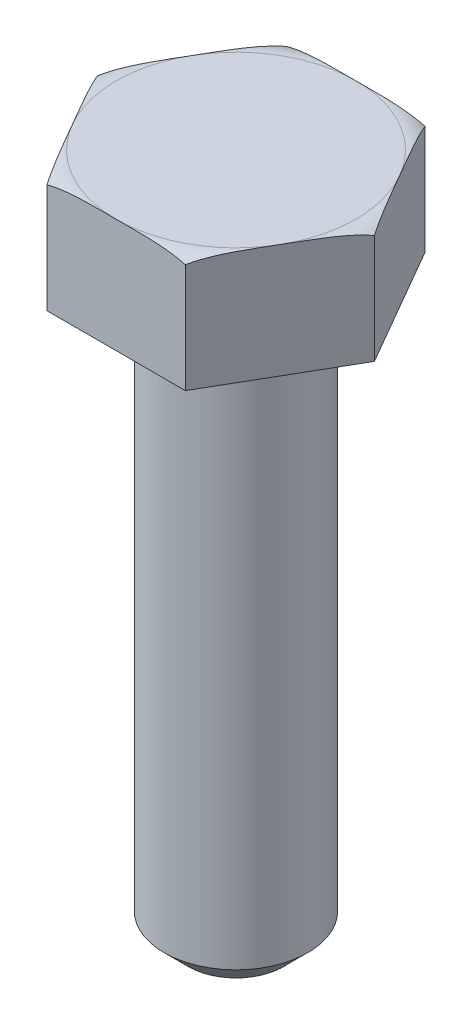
ISO-10303-21;
HEADER;
FILE_DESCRIPTION(('STEP AP214'),'2;1');
FILE_NAME('part.step','',(''),(''),'','','');
FILE_SCHEMA(('AUTOMOTIVE_DESIGN { 1 0 10303 214 1 1 1 1 }'));
ENDSEC;
DATA;
#1=APPLICATION_CONTEXT('core data for automotive mechanical design processes');
#2=APPLICATION_PROTOCOL_DEFINITION('international standard','automotive_design',2000,#1);
#3=PRODUCT_CONTEXT('',#1,'mechanical');
#4=PRODUCT('Part','Part','',(#3));
#5=PRODUCT_RELATED_PRODUCT_CATEGORY('part','',(#4));
#6=PRODUCT_DEFINITION_FORMATION('','',#4);
#7=PRODUCT_DEFINITION_CONTEXT('part definition',#1,'design');
#8=PRODUCT_DEFINITION('design','',#6,#7);
#9=PRODUCT_DEFINITION_SHAPE('','',#8);
#10=(LENGTH_UNIT() NAMED_UNIT(*) SI_UNIT(.MILLI.,.METRE.));
#11=(NAMED_UNIT(*) PLANE_ANGLE_UNIT() SI_UNIT($,.RADIAN.));
#12=(NAMED_UNIT(*) SI_UNIT($,.STERADIAN.) SOLID_ANGLE_UNIT());
#13=UNCERTAINTY_MEASURE_WITH_UNIT(LENGTH_MEASURE(1.E-05),#10,'distance_accuracy_value','');
#14=(GEOMETRIC_REPRESENTATION_CONTEXT(3) GLOBAL_UNCERTAINTY_ASSIGNED_CONTEXT((#13)) GLOBAL_UNIT_ASSIGNED_CONTEXT((#10,
#11,#12)) REPRESENTATION_CONTEXT('',''));
#15=CARTESIAN_POINT('',(0.,0.,0.));
#16=DIRECTION('',(0.,0.,1.));
#17=DIRECTION('',(1.,0.,0.));
#18=AXIS2_PLACEMENT_3D('',#15,#16,#17);
#19=CARTESIAN_POINT('',(1.6,-19.,0.));
#20=DIRECTION('',(0.,1.,0.));
#21=DIRECTION('',(-1.,0.,0.));
#22=AXIS2_PLACEMENT_3D('',#19,#20,#21);
#23=PLANE('',#22);
#24=CARTESIAN_POINT('',(0.,-19.,0.));
#25=DIRECTION('',(0.,1.,0.));
#26=DIRECTION('',(-1.,0.,0.));
#27=AXIS2_PLACEMENT_3D('',#24,#25,#26);
#28=CIRCLE('',#27,1.6);
#29=CARTESIAN_POINT('',(-1.6,-19.,0.));
#30=VERTEX_POINT('',#29);
#31=EDGE_CURVE('E11',#30,#30,#28,.T.);
#32=ORIENTED_EDGE('',*,*,#31,.F.);
#33=EDGE_LOOP('',(#32));
#34=FACE_BOUND('',#33,.T.);
#35=ADVANCED_FACE('F47',(#34),#23,.F.);
#36=CARTESIAN_POINT('',(0.,-19.,0.));
#37=DIRECTION('',(0.,1.,0.));
#38=DIRECTION('',(-1.,0.,0.));
#39=AXIS2_PLACEMENT_3D('',#36,#37,#38);
#40=CONICAL_SURFACE('',#39,1.6,0.785398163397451);
#41=CARTESIAN_POINT('',(0.,-18.2,0.));
#42=DIRECTION('',(0.,1.,0.));
#43=DIRECTION('',(-1.,0.,0.));
#44=AXIS2_PLACEMENT_3D('',#41,#42,#43);
#45=CIRCLE('',#44,2.4);
#46=CARTESIAN_POINT('',(-2.4,-18.2,0.));
#47=VERTEX_POINT('',#46);
#48=EDGE_CURVE('E53',#47,#47,#45,.T.);
#49=ORIENTED_EDGE('',*,*,#48,.F.);
#50=EDGE_LOOP('',(#49));
#51=FACE_BOUND('',#50,.T.);
#52=ORIENTED_EDGE('',*,*,#31,.T.);
#53=EDGE_LOOP('',(#52));
#54=FACE_BOUND('',#53,.T.);
#55=ADVANCED_FACE('F77',(#51,#54),#40,.T.);
#56=CARTESIAN_POINT('',(0.,0.,0.));
#57=DIRECTION('',(0.,1.,0.));
#58=DIRECTION('',(-1.,0.,0.));
#59=AXIS2_PLACEMENT_3D('',#56,#57,#58);
#60=CYLINDRICAL_SURFACE('',#59,2.4);
#61=CARTESIAN_POINT('',(0.,-0.24,0.));
#62=DIRECTION('',(0.,1.,0.));
#63=DIRECTION('',(-1.,0.,0.));
#64=AXIS2_PLACEMENT_3D('',#61,#62,#63);
#65=CIRCLE('',#64,2.4);
#66=CARTESIAN_POINT('',(-2.39999999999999,-0.24,0.));
#67=VERTEX_POINT('',#66);
#68=EDGE_CURVE('E57',#67,#67,#65,.T.);
#69=ORIENTED_EDGE('',*,*,#68,.F.);
#70=EDGE_LOOP('',(#69));
#71=FACE_BOUND('',#70,.T.);
#72=ORIENTED_EDGE('',*,*,#48,.T.);
#73=EDGE_LOOP('',(#72));
#74=FACE_BOUND('',#73,.T.);
#75=ADVANCED_FACE('F72',(#71,#74),#60,.T.);
#76=CARTESIAN_POINT('',(0.,-0.24,0.));
#77=DIRECTION('',(0.,1.,0.));
#78=DIRECTION('',(-1.,0.,0.));
#79=AXIS2_PLACEMENT_3D('',#76,#77,#78);
#80=TOROIDAL_SURFACE('',#79,2.64,0.24);
#81=CARTESIAN_POINT('',(0.,0.,0.));
#82=DIRECTION('',(0.,1.,0.));
#83=DIRECTION('',(-1.,0.,0.));
#84=AXIS2_PLACEMENT_3D('',#81,#82,#83);
#85=CIRCLE('',#84,2.64);
#86=CARTESIAN_POINT('',(-2.63999999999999,0.,0.));
#87=VERTEX_POINT('',#86);
#88=EDGE_CURVE('E61',#87,#87,#85,.T.);
#89=ORIENTED_EDGE('',*,*,#88,.F.);
#90=EDGE_LOOP('',(#89));
#91=FACE_BOUND('',#90,.T.);
#92=ORIENTED_EDGE('',*,*,#68,.T.);
#93=EDGE_LOOP('',(#92));
#94=FACE_BOUND('',#93,.T.);
#95=ADVANCED_FACE('F69',(#91,#94),#80,.F.);
#96=CARTESIAN_POINT('',(0.,0.,0.));
#97=DIRECTION('',(0.,-1.,0.));
#98=DIRECTION('',(1.,0.,0.));
#99=AXIS2_PLACEMENT_3D('',#96,#97,#98);
#100=PLANE('',#99);
#101=ORIENTED_EDGE('',*,*,#88,.T.);
#102=EDGE_LOOP('',(#101));
#103=FACE_BOUND('',#102,.T.);
#104=ADVANCED_FACE('F67',(#103),#100,.F.);
#105=CLOSED_SHELL('',(#35,#55,#75,#95,#104));
#106=MANIFOLD_SOLID_BREP('B2',#105);
#107=CARTESIAN_POINT('',(2.3094010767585,3.8,4.));
#108=DIRECTION('',(-0.866025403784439,0.,-0.5));
#109=DIRECTION('',(-0.5,0.,0.866025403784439));
#110=AXIS2_PLACEMENT_3D('',#107,#108,#109);
#111=PLANE('',#110);
#112=CARTESIAN_POINT('',(2.30928560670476,3.6384964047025,4.00019999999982));
#113=CARTESIAN_POINT('',(2.33148973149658,3.65092844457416,3.96174132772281));
#114=CARTESIAN_POINT('',(2.35383510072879,3.6622995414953,3.92303801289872));
#115=CARTESIAN_POINT('',(2.39873584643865,3.68314055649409,3.84526764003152));
#116=CARTESIAN_POINT('',(2.42129111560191,3.69261139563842,3.80620076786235));
#117=CARTESIAN_POINT('',(2.48908897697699,3.7184799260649,3.6887714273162));
#118=CARTESIAN_POINT('',(2.53456890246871,3.73239009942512,3.6099978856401));
#119=CARTESIAN_POINT('',(2.62553326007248,3.75506569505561,3.45244299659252));
#120=CARTESIAN_POINT('',(2.6710158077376,3.76386341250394,3.37366491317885));
#121=CARTESIAN_POINT('',(2.76214402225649,3.77779966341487,3.2158262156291));
#122=CARTESIAN_POINT('',(2.80778977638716,3.78293579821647,3.13676545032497));
#123=CARTESIAN_POINT('',(2.89885564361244,3.79067028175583,2.97903474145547));
#124=CARTESIAN_POINT('',(2.94427546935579,3.79328365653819,2.90036529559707));
#125=CARTESIAN_POINT('',(3.03513132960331,3.79697276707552,2.74299832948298));
#126=CARTESIAN_POINT('',(3.08056736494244,3.79804840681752,2.66430080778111));
#127=CARTESIAN_POINT('',(3.1715251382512,3.79940881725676,2.50675732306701));
#128=CARTESIAN_POINT('',(3.21704687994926,3.79969212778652,2.42791135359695));
#129=CARTESIAN_POINT('',(3.30809301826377,3.79998391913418,2.27021481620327));
#130=CARTESIAN_POINT('',(3.35361741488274,3.79999238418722,2.19136424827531));
#131=CARTESIAN_POINT('',(3.45004566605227,3.80000479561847,2.02434561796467));
#132=CARTESIAN_POINT('',(3.50094952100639,3.80000808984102,1.93617755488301));
#133=CARTESIAN_POINT('',(3.60275363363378,3.79998021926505,1.75984765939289));
#134=CARTESIAN_POINT('',(3.65365389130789,3.7999490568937,1.67168582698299));
#135=CARTESIAN_POINT('',(3.75536252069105,3.79939630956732,1.49552131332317));
#136=CARTESIAN_POINT('',(3.80617089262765,3.7988756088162,1.40751863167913));
#137=CARTESIAN_POINT('',(3.90777936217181,3.79650670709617,1.23152759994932));
#138=CARTESIAN_POINT('',(3.95857946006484,3.79465857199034,1.14353924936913));
#139=CARTESIAN_POINT('',(4.06048825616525,3.78843800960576,0.967028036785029));
#140=CARTESIAN_POINT('',(4.11159673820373,3.78404872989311,0.878505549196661));
#141=CARTESIAN_POINT('',(4.21365397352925,3.77123148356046,0.701737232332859));
#142=CARTESIAN_POINT('',(4.26460282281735,3.76280679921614,0.613491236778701));
#143=CARTESIAN_POINT('',(4.36651459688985,3.74004977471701,0.436974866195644));
#144=CARTESIAN_POINT('',(4.41747567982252,3.72568140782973,0.348707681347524));
#145=CARTESIAN_POINT('',(4.49344377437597,3.69805892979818,0.217127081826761));
#146=CARTESIAN_POINT('',(4.51872392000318,3.68782047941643,0.173340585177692));
#147=CARTESIAN_POINT('',(4.56903374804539,3.66499711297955,0.086201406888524));
#148=CARTESIAN_POINT('',(4.59406325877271,3.65241069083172,0.0428490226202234));
#149=CARTESIAN_POINT('',(4.61891762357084,3.63849640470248,-0.000200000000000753));
#150=B_SPLINE_CURVE_WITH_KNOTS('',3,(#112,#113,#114,#115,#116,#117,#118,#119,#120,#121,#122,
#123,#124,#125,#126,#127,#128,#129,#130,#131,#132,#133,#134,#135,#136,#137,#138,#139,#140,#141,
#142,#143,#144,#145,#146,#147,#148,#149),.UNSPECIFIED.,.F.,.F.,(4,2,2,2,2,2,2,2,2,2,2,2,2,2,2,2,
2,2,4),(0.,0.138312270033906,0.276557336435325,0.552395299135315,0.826471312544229,
1.10072670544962,1.37333831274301,1.64596694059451,1.91909766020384,2.19224404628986,
2.49766716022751,2.80306876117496,3.10791980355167,3.41275572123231,3.71963680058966,
4.02626869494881,4.33478707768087,4.48949630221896,4.64430510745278),.UNSPECIFIED.);
#151=CARTESIAN_POINT('',(2.30940107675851,3.63856106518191,4.));
#152=VERTEX_POINT('',#151);
#153=CARTESIAN_POINT('',(3.46410161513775,3.8,2.));
#154=VERTEX_POINT('',#153);
#155=EDGE_CURVE('E205',#152,#154,#150,.T.);
#156=ORIENTED_EDGE('',*,*,#155,.F.);
#157=DIRECTION('',(0.,-1.,0.));
#158=VECTOR('',#157,1.);
#159=CARTESIAN_POINT('',(2.3094010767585,3.8,4.));
#160=LINE('',#159,#158);
#161=CARTESIAN_POINT('',(2.3094010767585,0.,4.));
#162=VERTEX_POINT('',#161);
#163=EDGE_CURVE('E431',#152,#162,#160,.T.);
#164=ORIENTED_EDGE('',*,*,#163,.T.);
#165=DIRECTION('',(0.5,0.,-0.866025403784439));
#166=VECTOR('',#165,1.);
#167=CARTESIAN_POINT('',(2.3094010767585,0.,4.));
#168=LINE('',#167,#166);
#169=CARTESIAN_POINT('',(4.61880215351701,0.,0.));
#170=VERTEX_POINT('',#169);
#171=EDGE_CURVE('E218',#162,#170,#168,.T.);
#172=ORIENTED_EDGE('',*,*,#171,.T.);
#173=DIRECTION('',(0.,-1.,0.));
#174=VECTOR('',#173,1.);
#175=CARTESIAN_POINT('',(4.61880215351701,3.8,0.));
#176=LINE('',#175,#174);
#177=CARTESIAN_POINT('',(4.61880215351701,3.63856106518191,0.));
#178=VERTEX_POINT('',#177);
#179=EDGE_CURVE('E211',#178,#170,#176,.T.);
#180=ORIENTED_EDGE('',*,*,#179,.F.);
#181=EDGE_CURVE('E195',#154,#178,#150,.T.);
#182=ORIENTED_EDGE('',*,*,#181,.F.);
#183=EDGE_LOOP('',(#156,#164,#172,#180,#182));
#184=FACE_BOUND('',#183,.T.);
#185=ADVANCED_FACE('F122',(#184),#111,.F.);
#186=CARTESIAN_POINT('',(4.61880215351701,3.8,0.));
#187=DIRECTION('',(-0.866025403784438,0.,0.5));
#188=DIRECTION('',(0.5,0.,0.866025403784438));
#189=AXIS2_PLACEMENT_3D('',#186,#187,#188);
#190=PLANE('',#189);
#191=CARTESIAN_POINT('',(4.61891762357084,3.63849640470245,0.000199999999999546));
#192=CARTESIAN_POINT('',(4.59671349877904,3.65092844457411,-0.0382586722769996));
#193=CARTESIAN_POINT('',(4.57436812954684,3.66229954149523,-0.076961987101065));
#194=CARTESIAN_POINT('',(4.529467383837,3.68314055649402,-0.154732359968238));
#195=CARTESIAN_POINT('',(4.50691211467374,3.69261139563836,-0.193799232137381));
#196=CARTESIAN_POINT('',(4.4391142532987,3.71847992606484,-0.311228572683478));
#197=CARTESIAN_POINT('',(4.393634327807,3.73239009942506,-0.390002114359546));
#198=CARTESIAN_POINT('',(4.30266997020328,3.75506569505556,-0.547557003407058));
#199=CARTESIAN_POINT('',(4.25718742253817,3.76386341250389,-0.626335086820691));
#200=CARTESIAN_POINT('',(4.16605920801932,3.77779966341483,-0.78417378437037));
#201=CARTESIAN_POINT('',(4.12041345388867,3.78293579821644,-0.863234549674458));
#202=CARTESIAN_POINT('',(4.02934758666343,3.79067028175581,-1.02096525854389));
#203=CARTESIAN_POINT('',(3.98392776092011,3.79328365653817,-1.09963470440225));
#204=CARTESIAN_POINT('',(3.89307190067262,3.7969727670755,-1.25700167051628));
#205=CARTESIAN_POINT('',(3.84763586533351,3.79804840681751,-1.33569919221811));
#206=CARTESIAN_POINT('',(3.75667809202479,3.79940881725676,-1.49324267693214));
#207=CARTESIAN_POINT('',(3.71115635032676,3.79969212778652,-1.57208864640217));
#208=CARTESIAN_POINT('',(3.62011021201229,3.79998391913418,-1.72978518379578));
#209=CARTESIAN_POINT('',(3.57458581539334,3.79999238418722,-1.80863575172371));
#210=CARTESIAN_POINT('',(3.47815756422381,3.80000479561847,-1.97565438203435));
#211=CARTESIAN_POINT('',(3.42725370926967,3.80000808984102,-2.06382244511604));
#212=CARTESIAN_POINT('',(3.32544959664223,3.79998021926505,-2.24015234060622));
#213=CARTESIAN_POINT('',(3.2745493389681,3.7999490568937,-2.32831417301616));
#214=CARTESIAN_POINT('',(3.1728407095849,3.79939630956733,-2.50447868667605));
#215=CARTESIAN_POINT('',(3.12203233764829,3.7988756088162,-2.59248136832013));
#216=CARTESIAN_POINT('',(3.02042386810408,3.79650670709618,-2.76847240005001));
#217=CARTESIAN_POINT('',(2.96962377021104,3.79465857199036,-2.85646075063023));
#218=CARTESIAN_POINT('',(2.86771497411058,3.78843800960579,-3.0329719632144));
#219=CARTESIAN_POINT('',(2.81660649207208,3.78404872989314,-3.12149445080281));
#220=CARTESIAN_POINT('',(2.71454925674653,3.7712314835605,-3.29826276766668));
#221=CARTESIAN_POINT('',(2.66360040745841,3.76280679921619,-3.38650876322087));
#222=CARTESIAN_POINT('',(2.56168863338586,3.74004977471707,-3.563025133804));
#223=CARTESIAN_POINT('',(2.51072755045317,3.72568140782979,-3.65129231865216));
#224=CARTESIAN_POINT('',(2.43475945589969,3.69805892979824,-3.78287291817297));
#225=CARTESIAN_POINT('',(2.40947931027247,3.68782047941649,-3.82665941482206));
#226=CARTESIAN_POINT('',(2.35916948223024,3.66499711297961,-3.91379859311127));
#227=CARTESIAN_POINT('',(2.33413997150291,3.65241069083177,-3.95715097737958));
#228=CARTESIAN_POINT('',(2.30928560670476,3.63849640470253,-4.00019999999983));
#229=B_SPLINE_CURVE_WITH_KNOTS('',3,(#191,#192,#193,#194,#195,#196,#197,#198,#199,#200,#201,
#202,#203,#204,#205,#206,#207,#208,#209,#210,#211,#212,#213,#214,#215,#216,#217,#218,#219,#220,
#221,#222,#223,#224,#225,#226,#227,#228),.UNSPECIFIED.,.F.,.F.,(4,2,2,2,2,2,2,2,2,2,2,2,2,2,2,2,
2,2,4),(0.,0.138312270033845,0.276557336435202,0.55239529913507,0.826471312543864,
1.10072670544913,1.3733383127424,1.64596694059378,1.919097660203,2.19224404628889,
2.49766716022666,2.80306876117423,3.10791980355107,3.41275572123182,3.7196368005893,
4.02626869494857,4.33478707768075,4.4894963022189,4.64430510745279),.UNSPECIFIED.);
#230=CARTESIAN_POINT('',(3.46410161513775,3.8,-2.));
#231=VERTEX_POINT('',#230);
#232=EDGE_CURVE('E198',#178,#231,#229,.T.);
#233=ORIENTED_EDGE('',*,*,#232,.F.);
#234=ORIENTED_EDGE('',*,*,#179,.T.);
#235=DIRECTION('',(-0.5,0.,-0.866025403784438));
#236=VECTOR('',#235,1.);
#237=CARTESIAN_POINT('',(4.61880215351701,0.,0.));
#238=LINE('',#237,#236);
#239=CARTESIAN_POINT('',(2.3094010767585,0.,-4.));
#240=VERTEX_POINT('',#239);
#241=EDGE_CURVE('E419',#170,#240,#238,.T.);
#242=ORIENTED_EDGE('',*,*,#241,.T.);
#243=DIRECTION('',(0.,-1.,0.));
#244=VECTOR('',#243,1.);
#245=CARTESIAN_POINT('',(2.3094010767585,3.8,-4.));
#246=LINE('',#245,#244);
#247=CARTESIAN_POINT('',(2.3094010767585,3.63856106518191,-4.));
#248=VERTEX_POINT('',#247);
#249=EDGE_CURVE('E219',#248,#240,#246,.T.);
#250=ORIENTED_EDGE('',*,*,#249,.F.);
#251=EDGE_CURVE('E214',#231,#248,#229,.T.);
#252=ORIENTED_EDGE('',*,*,#251,.F.);
#253=EDGE_LOOP('',(#233,#234,#242,#250,#252));
#254=FACE_BOUND('',#253,.T.);
#255=ADVANCED_FACE('F209',(#254),#190,.F.);
#256=CARTESIAN_POINT('',(2.3094010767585,3.8,-4.));
#257=DIRECTION('',(0.,0.,1.));
#258=DIRECTION('',(1.,0.,0.));
#259=AXIS2_PLACEMENT_3D('',#256,#257,#258);
#260=PLANE('',#259);
#261=CARTESIAN_POINT('',(0.,3.80000000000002,-4.));
#262=CARTESIAN_POINT('',(-0.107101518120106,3.80000279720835,-4.));
#263=CARTESIAN_POINT('',(-0.214203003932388,3.80002273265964,-4.));
#264=CARTESIAN_POINT('',(-0.428411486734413,3.79984621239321,-4.));
#265=CARTESIAN_POINT('',(-0.535518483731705,3.79964974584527,-4.));
#266=CARTESIAN_POINT('',(-0.75007473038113,3.79827019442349,-4.));
#267=CARTESIAN_POINT('',(-0.85752396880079,3.79708392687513,-4.));
#268=CARTESIAN_POINT('',(-1.07237290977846,3.79250014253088,-4.));
#269=CARTESIAN_POINT('',(-1.17977261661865,3.78910288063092,-4.));
#270=CARTESIAN_POINT('',(-1.39318916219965,3.77854406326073,-4.));
#271=CARTESIAN_POINT('',(-1.49920790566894,3.7714255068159,-4.));
#272=CARTESIAN_POINT('',(-1.71082265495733,3.75153618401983,-4.));
#273=CARTESIAN_POINT('',(-1.8164183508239,3.73876184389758,-4.));
#274=CARTESIAN_POINT('',(-2.02564253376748,3.70541744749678,-4.));
#275=CARTESIAN_POINT('',(-2.12927971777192,3.6849043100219,-4.));
#276=CARTESIAN_POINT('',(-2.33389450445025,3.63350907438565,-4.));
#277=CARTESIAN_POINT('',(-2.43487681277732,3.60264687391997,-4.));
#278=CARTESIAN_POINT('',(-2.58375540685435,3.54591292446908,-4.));
#279=CARTESIAN_POINT('',(-2.63351503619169,3.52495233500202,-4.));
#280=CARTESIAN_POINT('',(-2.73122455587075,3.4791108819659,-4.));
#281=CARTESIAN_POINT('',(-2.7791726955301,3.45422634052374,-4.));
#282=CARTESIAN_POINT('',(-2.91888468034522,3.37325704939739,-4.));
#283=CARTESIAN_POINT('',(-3.00718409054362,3.31061977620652,-4.));
#284=CARTESIAN_POINT('',(-3.12827872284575,3.20017995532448,-4.));
#285=CARTESIAN_POINT('',(-3.16754557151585,3.15941662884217,-4.));
#286=CARTESIAN_POINT('',(-3.23962701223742,3.07241657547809,-4.));
#287=CARTESIAN_POINT('',(-3.27243948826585,3.02617806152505,-4.));
#288=CARTESIAN_POINT('',(-3.33001619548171,2.92828556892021,-4.));
#289=CARTESIAN_POINT('',(-3.35470297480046,2.87658534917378,-4.));
#290=CARTESIAN_POINT('',(-3.39373088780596,2.76941828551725,-4.));
#291=CARTESIAN_POINT('',(-3.40808570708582,2.7139565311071,-4.));
#292=CARTESIAN_POINT('',(-3.42425657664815,2.60746483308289,-4.));
#293=CARTESIAN_POINT('',(-3.42727632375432,2.55661692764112,-4.));
#294=CARTESIAN_POINT('',(-3.42390006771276,2.45523707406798,-4.));
#295=CARTESIAN_POINT('',(-3.41750543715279,2.40470508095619,-4.));
#296=CARTESIAN_POINT('',(-3.39668580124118,2.30966040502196,-4.));
#297=CARTESIAN_POINT('',(-3.38295501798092,2.2649921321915,-4.));
#298=CARTESIAN_POINT('',(-3.34878746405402,2.17832763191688,-4.));
#299=CARTESIAN_POINT('',(-3.32834974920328,2.13633178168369,-4.));
#300=CARTESIAN_POINT('',(-3.27392047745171,2.04210159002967,-4.));
#301=CARTESIAN_POINT('',(-3.23768213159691,1.99116478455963,-4.));
#302=CARTESIAN_POINT('',(-3.15739103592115,1.89585584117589,-4.));
#303=CARTESIAN_POINT('',(-3.11332135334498,1.85149831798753,-4.));
#304=CARTESIAN_POINT('',(-2.99964214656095,1.75199000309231,-4.));
#305=CARTESIAN_POINT('',(-2.9271090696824,1.70019787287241,-4.));
#306=CARTESIAN_POINT('',(-2.77502219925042,1.60857675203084,-4.));
#307=CARTESIAN_POINT('',(-2.69546302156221,1.56875704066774,-4.));
#308=CARTESIAN_POINT('',(-2.54303388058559,1.50382566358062,-4.));
#309=CARTESIAN_POINT('',(-2.47068305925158,1.47746177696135,-4.));
#310=CARTESIAN_POINT('',(-2.32394192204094,1.43108324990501,-4.));
#311=CARTESIAN_POINT('',(-2.24954990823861,1.41107408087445,-4.));
#312=CARTESIAN_POINT('',(-2.09925340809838,1.37624847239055,-4.));
#313=CARTESIAN_POINT('',(-2.02334380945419,1.36145463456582,-4.));
#314=CARTESIAN_POINT('',(-1.87087217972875,1.33617618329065,-4.));
#315=CARTESIAN_POINT('',(-1.79431052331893,1.32568924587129,-4.));
#316=CARTESIAN_POINT('',(-1.59455003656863,1.3028008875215,-4.));
#317=CARTESIAN_POINT('',(-1.47105490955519,1.29305522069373,-4.));
#318=CARTESIAN_POINT('',(-1.22373459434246,1.27907737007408,-4.));
#319=CARTESIAN_POINT('',(-1.099909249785,1.27484858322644,-4.));
#320=CARTESIAN_POINT('',(-0.851960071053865,1.26937726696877,-4.));
#321=CARTESIAN_POINT('',(-0.727836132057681,1.26814067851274,-4.));
#322=CARTESIAN_POINT('',(-0.479622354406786,1.26681357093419,-4.));
#323=CARTESIAN_POINT('',(-0.355532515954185,1.26672273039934,-4.));
#324=CARTESIAN_POINT('',(-0.106890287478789,1.26664579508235,-4.));
#325=CARTESIAN_POINT('',(0.0176621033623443,1.26666009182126,-4.));
#326=CARTESIAN_POINT('',(0.266785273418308,1.26667828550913,-4.));
#327=CARTESIAN_POINT('',(0.391356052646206,1.26668218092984,-4.));
#328=CARTESIAN_POINT('',(0.640342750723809,1.26751758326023,-4.));
#329=CARTESIAN_POINT('',(0.764758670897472,1.26834806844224,-4.));
#330=CARTESIAN_POINT('',(1.01353993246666,1.27252171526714,-4.));
#331=CARTESIAN_POINT('',(1.13790527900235,1.27586436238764,-4.));
#332=CARTESIAN_POINT('',(1.36374278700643,1.28642404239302,-4.));
#333=CARTESIAN_POINT('',(1.46524934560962,1.29282233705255,-4.));
#334=CARTESIAN_POINT('',(1.66792102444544,1.31057273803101,-4.));
#335=CARTESIAN_POINT('',(1.7690859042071,1.3219278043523,-4.));
#336=CARTESIAN_POINT('',(1.96957989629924,1.35140271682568,-4.));
#337=CARTESIAN_POINT('',(2.06891731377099,1.36946356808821,-4.));
#338=CARTESIAN_POINT('',(2.26549579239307,1.41454235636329,-4.));
#339=CARTESIAN_POINT('',(2.36273960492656,1.44154766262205,-4.));
#340=CARTESIAN_POINT('',(2.52999475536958,1.49900799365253,-4.));
#341=CARTESIAN_POINT('',(2.60084175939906,1.52699747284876,-4.));
#342=CARTESIAN_POINT('',(2.73921034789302,1.59078946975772,-4.));
#343=CARTESIAN_POINT('',(2.80672365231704,1.62661034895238,-4.));
#344=CARTESIAN_POINT('',(2.93692219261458,1.70757834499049,-4.));
#345=CARTESIAN_POINT('',(2.99955448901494,1.75281221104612,-4.));
#346=CARTESIAN_POINT('',(3.11621445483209,1.85325712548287,-4.));
#347=CARTESIAN_POINT('',(3.17026565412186,1.90843997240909,-4.));
#348=CARTESIAN_POINT('',(3.25112119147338,2.01019020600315,-4.));
#349=CARTESIAN_POINT('',(3.28118654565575,2.05416164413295,-4.));
#350=CARTESIAN_POINT('',(3.33384441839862,2.14641403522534,-4.));
#351=CARTESIAN_POINT('',(3.35644048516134,2.19469292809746,-4.));
#352=CARTESIAN_POINT('',(3.39282142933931,2.29491434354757,-4.));
#353=CARTESIAN_POINT('',(3.4065401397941,2.34688124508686,-4.));
#354=CARTESIAN_POINT('',(3.4237887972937,2.45248200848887,-4.));
#355=CARTESIAN_POINT('',(3.42732498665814,2.50611482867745,-4.));
#356=CARTESIAN_POINT('',(3.42411694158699,2.60706608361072,-4.));
#357=CARTESIAN_POINT('',(3.41847251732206,2.65442327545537,-4.));
#358=CARTESIAN_POINT('',(3.39931334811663,2.74750154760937,-4.));
#359=CARTESIAN_POINT('',(3.38579867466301,2.79322264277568,-4.));
#360=CARTESIAN_POINT('',(3.3516829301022,2.88204634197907,-4.));
#361=CARTESIAN_POINT('',(3.33106310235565,2.92514165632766,-4.));
#362=CARTESIAN_POINT('',(3.28381663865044,3.00788083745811,-4.));
#363=CARTESIAN_POINT('',(3.25718686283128,3.04752288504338,-4.));
#364=CARTESIAN_POINT('',(3.18501990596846,3.14113619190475,-4.));
#365=CARTESIAN_POINT('',(3.1365442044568,3.19284648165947,-4.));
#366=CARTESIAN_POINT('',(3.03195426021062,3.28781460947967,-4.));
#367=CARTESIAN_POINT('',(2.97582442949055,3.33105474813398,-4.));
#368=CARTESIAN_POINT('',(2.82786059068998,3.43007779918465,-4.));
#369=CARTESIAN_POINT('',(2.73260450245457,3.48073869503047,-4.));
#370=CARTESIAN_POINT('',(2.585015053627,3.54544386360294,-4.));
#371=CARTESIAN_POINT('',(2.53496165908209,3.56515068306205,-4.));
#372=CARTESIAN_POINT('',(2.43367410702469,3.60122245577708,-4.));
#373=CARTESIAN_POINT('',(2.38244049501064,3.6175889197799,-4.));
#374=CARTESIAN_POINT('',(2.2469128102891,3.65667221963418,-4.));
#375=CARTESIAN_POINT('',(2.1619302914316,3.67698256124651,-4.));
#376=CARTESIAN_POINT('',(1.9906988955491,3.71142193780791,-4.));
#377=CARTESIAN_POINT('',(1.90444903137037,3.7255458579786,-4.));
#378=CARTESIAN_POINT('',(1.73102836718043,3.74901026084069,-4.));
#379=CARTESIAN_POINT('',(1.64385544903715,3.75833454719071,-4.));
#380=CARTESIAN_POINT('',(1.46923700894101,3.77334607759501,-4.));
#381=CARTESIAN_POINT('',(1.38179156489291,3.77903427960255,-4.));
#382=CARTESIAN_POINT('',(1.20632422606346,3.78785747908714,-4.));
#383=CARTESIAN_POINT('',(1.11830170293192,3.79097900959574,-4.));
#384=CARTESIAN_POINT('',(0.942211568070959,3.79553019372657,-4.));
#385=CARTESIAN_POINT('',(0.854143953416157,3.79695971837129,-4.));
#386=CARTESIAN_POINT('',(0.678134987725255,3.79886305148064,-4.));
#387=CARTESIAN_POINT('',(0.590193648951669,3.79933831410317,-4.));
#388=CARTESIAN_POINT('',(0.414312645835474,3.79988273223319,-4.));
#389=CARTESIAN_POINT('',(0.326372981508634,3.79995189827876,-4.));
#390=CARTESIAN_POINT('',(0.198708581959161,3.79999284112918,-4.));
#391=CARTESIAN_POINT('',(0.158983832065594,3.79999722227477,-4.));
#392=CARTESIAN_POINT('',(0.0795060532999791,3.80000028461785,-4.));
#393=CARTESIAN_POINT('',(0.0397530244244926,3.79999896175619,-4.));
#394=CARTESIAN_POINT('',(0.,3.80000000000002,-4.));
#395=B_SPLINE_CURVE_WITH_KNOTS('',3,(#261,#262,#263,#264,#265,#266,#267,#268,#269,#270,#271,
#272,#273,#274,#275,#276,#277,#278,#279,#280,#281,#282,#283,#284,#285,#286,#287,#288,#289,#290,
#291,#292,#293,#294,#295,#296,#297,#298,#299,#300,#301,#302,#303,#304,#305,#306,#307,#308,#309,
#310,#311,#312,#313,#314,#315,#316,#317,#318,#319,#320,#321,#322,#323,#324,#325,#326,#327,#328,
#329,#330,#331,#332,#333,#334,#335,#336,#337,#338,#339,#340,#341,#342,#343,#344,#345,#346,#347,
#348,#349,#350,#351,#352,#353,#354,#355,#356,#357,#358,#359,#360,#361,#362,#363,#364,#365,#366,
#367,#368,#369,#370,#371,#372,#373,#374,#375,#376,#377,#378,#379,#380,#381,#382,#383,#384,#385,
#386,#387,#388,#389,#390,#391,#392,#393,#394),.UNSPECIFIED.,.T.,.F.,(4,2,2,2,2,2,2,2,2,2,2,2,2,
2,2,2,2,2,2,2,2,2,2,2,2,2,2,2,2,2,2,2,2,2,2,2,2,2,2,2,2,2,2,2,2,2,2,2,2,2,2,2,2,2,2,2,2,2,2,2,2,
2,2,2,2,2,4),(0.,0.32130457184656,0.642625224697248,0.964983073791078,1.28730376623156,
1.60597982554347,1.92485753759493,2.24143423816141,2.5574057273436,2.71922271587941,
2.88119228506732,3.20302883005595,3.37233082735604,3.54168823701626,3.71261607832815,
3.88331709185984,4.03527509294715,4.1872109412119,4.32680971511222,4.46642814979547,
4.65293123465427,4.83984259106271,5.10572905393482,5.37182106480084,5.60249554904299,
5.83336810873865,6.06522924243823,6.29696510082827,6.66837381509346,7.0400111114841,
7.41238568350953,7.78465579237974,8.15831289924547,8.53202490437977,8.90527554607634,
9.27844976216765,9.58349538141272,9.88872341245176,10.1913274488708,10.4935059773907,
10.7216621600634,10.9503591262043,11.1812653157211,11.4115269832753,11.5707353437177,
11.7298679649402,11.890173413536,12.050380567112,12.1927667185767,12.3351515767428,
12.4779152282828,12.6207536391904,12.8321873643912,13.0440583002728,13.3657887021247,
13.5271019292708,13.6883420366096,13.9501549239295,14.2121838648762,14.4750913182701,
14.7379294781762,15.0021380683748,15.2663667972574,15.5301925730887,15.7940115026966,
15.9131857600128,16.0324448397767),.UNSPECIFIED.);
#396=CARTESIAN_POINT('',(0.,3.8,-4.));
#397=VERTEX_POINT('',#396);
#398=EDGE_CURVE('E240',#248,#397,#395,.T.);
#399=ORIENTED_EDGE('',*,*,#398,.F.);
#400=ORIENTED_EDGE('',*,*,#249,.T.);
#401=DIRECTION('',(-1.,0.,0.));
#402=VECTOR('',#401,1.);
#403=CARTESIAN_POINT('',(2.3094010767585,0.,-4.));
#404=LINE('',#403,#402);
#405=CARTESIAN_POINT('',(-2.3094010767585,0.,-4.));
#406=VERTEX_POINT('',#405);
#407=EDGE_CURVE('E420',#240,#406,#404,.T.);
#408=ORIENTED_EDGE('',*,*,#407,.T.);
#409=DIRECTION('',(0.,-1.,0.));
#410=VECTOR('',#409,1.);
#411=CARTESIAN_POINT('',(-2.3094010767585,3.8,-4.));
#412=LINE('',#411,#410);
#413=CARTESIAN_POINT('',(-2.30940107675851,3.63856106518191,-4.));
#414=VERTEX_POINT('',#413);
#415=EDGE_CURVE('E222',#414,#406,#412,.T.);
#416=ORIENTED_EDGE('',*,*,#415,.F.);
#417=EDGE_CURVE('E247',#397,#414,#395,.T.);
#418=ORIENTED_EDGE('',*,*,#417,.F.);
#419=EDGE_LOOP('',(#399,#400,#408,#416,#418));
#420=FACE_BOUND('',#419,.T.);
#421=ADVANCED_FACE('F248',(#420),#260,.F.);
#422=CARTESIAN_POINT('',(-2.3094010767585,3.8,-4.));
#423=DIRECTION('',(0.866025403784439,0.,0.5));
#424=DIRECTION('',(0.5,0.,-0.866025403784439));
#425=AXIS2_PLACEMENT_3D('',#422,#423,#424);
#426=PLANE('',#425);
#427=CARTESIAN_POINT('',(-2.30928560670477,3.6384964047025,-4.00019999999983));
#428=CARTESIAN_POINT('',(-2.33148973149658,3.65092844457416,-3.96174132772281));
#429=CARTESIAN_POINT('',(-2.35383510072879,3.66229954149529,-3.92303801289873));
#430=CARTESIAN_POINT('',(-2.39873584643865,3.68314055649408,-3.84526764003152));
#431=CARTESIAN_POINT('',(-2.42129111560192,3.69261139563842,-3.80620076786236));
#432=CARTESIAN_POINT('',(-2.489088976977,3.7184799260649,-3.68877142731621));
#433=CARTESIAN_POINT('',(-2.53456890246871,3.73239009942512,-3.6099978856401));
#434=CARTESIAN_POINT('',(-2.62553326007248,3.75506569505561,-3.45244299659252));
#435=CARTESIAN_POINT('',(-2.6710158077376,3.76386341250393,-3.37366491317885));
#436=CARTESIAN_POINT('',(-2.76214402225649,3.77779966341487,-3.2158262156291));
#437=CARTESIAN_POINT('',(-2.80778977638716,3.78293579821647,-3.13676545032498));
#438=CARTESIAN_POINT('',(-2.89885564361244,3.79067028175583,-2.97903474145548));
#439=CARTESIAN_POINT('',(-2.94427546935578,3.79328365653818,-2.90036529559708));
#440=CARTESIAN_POINT('',(-3.03513132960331,3.79697276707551,-2.74299832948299));
#441=CARTESIAN_POINT('',(-3.08056736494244,3.79804840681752,-2.66430080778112));
#442=CARTESIAN_POINT('',(-3.1715251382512,3.79940881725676,-2.50675732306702));
#443=CARTESIAN_POINT('',(-3.21704687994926,3.79969212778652,-2.42791135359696));
#444=CARTESIAN_POINT('',(-3.30809301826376,3.79998391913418,-2.27021481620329));
#445=CARTESIAN_POINT('',(-3.35361741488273,3.79999238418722,-2.19136424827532));
#446=CARTESIAN_POINT('',(-3.45004566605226,3.80000479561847,-2.02434561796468));
#447=CARTESIAN_POINT('',(-3.50094952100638,3.80000808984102,-1.93617755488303));
#448=CARTESIAN_POINT('',(-3.60275363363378,3.79998021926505,-1.75984765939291));
#449=CARTESIAN_POINT('',(-3.65365389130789,3.7999490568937,-1.67168582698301));
#450=CARTESIAN_POINT('',(-3.75536252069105,3.79939630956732,-1.49552131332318));
#451=CARTESIAN_POINT('',(-3.80617089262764,3.7988756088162,-1.40751863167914));
#452=CARTESIAN_POINT('',(-3.90777936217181,3.79650670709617,-1.23152759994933));
#453=CARTESIAN_POINT('',(-3.95857946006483,3.79465857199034,-1.14353924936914));
#454=CARTESIAN_POINT('',(-4.06048825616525,3.78843800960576,-0.967028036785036));
#455=CARTESIAN_POINT('',(-4.11159673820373,3.78404872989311,-0.878505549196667));
#456=CARTESIAN_POINT('',(-4.21365397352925,3.77123148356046,-0.701737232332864));
#457=CARTESIAN_POINT('',(-4.26460282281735,3.76280679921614,-0.613491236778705));
#458=CARTESIAN_POINT('',(-4.36651459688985,3.74004977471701,-0.436974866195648));
#459=CARTESIAN_POINT('',(-4.41747567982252,3.72568140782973,-0.348707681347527));
#460=CARTESIAN_POINT('',(-4.49344377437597,3.69805892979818,-0.217127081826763));
#461=CARTESIAN_POINT('',(-4.51872392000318,3.68782047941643,-0.173340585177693));
#462=CARTESIAN_POINT('',(-4.56903374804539,3.66499711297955,-0.086201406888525));
#463=CARTESIAN_POINT('',(-4.59406325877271,3.65241069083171,-0.0428490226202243));
#464=CARTESIAN_POINT('',(-4.61891762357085,3.63849640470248,0.000199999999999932));
#465=B_SPLINE_CURVE_WITH_KNOTS('',3,(#427,#428,#429,#430,#431,#432,#433,#434,#435,#436,#437,
#438,#439,#440,#441,#442,#443,#444,#445,#446,#447,#448,#449,#450,#451,#452,#453,#454,#455,#456,
#457,#458,#459,#460,#461,#462,#463,#464),.UNSPECIFIED.,.F.,.F.,(4,2,2,2,2,2,2,2,2,2,2,2,2,2,2,2,
2,2,4),(0.,0.138312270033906,0.276557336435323,0.55239529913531,0.826471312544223,
1.10072670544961,1.373338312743,1.6459669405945,1.91909766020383,2.19224404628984,
2.4976671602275,2.80306876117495,3.10791980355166,3.4127557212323,3.71963680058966,
4.02626869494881,4.33478707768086,4.48949630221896,4.64430510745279),.UNSPECIFIED.);
#466=CARTESIAN_POINT('',(-3.46410161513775,3.8,-2.));
#467=VERTEX_POINT('',#466);
#468=EDGE_CURVE('E251',#414,#467,#465,.T.);
#469=ORIENTED_EDGE('',*,*,#468,.F.);
#470=ORIENTED_EDGE('',*,*,#415,.T.);
#471=DIRECTION('',(-0.5,0.,0.866025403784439));
#472=VECTOR('',#471,1.);
#473=CARTESIAN_POINT('',(-2.3094010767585,0.,-4.));
#474=LINE('',#473,#472);
#475=CARTESIAN_POINT('',(-4.61880215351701,0.,0.));
#476=VERTEX_POINT('',#475);
#477=EDGE_CURVE('E424',#406,#476,#474,.T.);
#478=ORIENTED_EDGE('',*,*,#477,.T.);
#479=DIRECTION('',(0.,-1.,0.));
#480=VECTOR('',#479,1.);
#481=CARTESIAN_POINT('',(-4.61880215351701,3.8,0.));
#482=LINE('',#481,#480);
#483=CARTESIAN_POINT('',(-4.61880215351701,3.63856106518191,0.));
#484=VERTEX_POINT('',#483);
#485=EDGE_CURVE('E435',#484,#476,#482,.T.);
#486=ORIENTED_EDGE('',*,*,#485,.F.);
#487=EDGE_CURVE('E254',#467,#484,#465,.T.);
#488=ORIENTED_EDGE('',*,*,#487,.F.);
#489=EDGE_LOOP('',(#469,#470,#478,#486,#488));
#490=FACE_BOUND('',#489,.T.);
#491=ADVANCED_FACE('F309',(#490),#426,.F.);
#492=CARTESIAN_POINT('',(-4.61880215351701,3.8,0.));
#493=DIRECTION('',(0.866025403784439,0.,-0.5));
#494=DIRECTION('',(-0.5,0.,-0.866025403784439));
#495=AXIS2_PLACEMENT_3D('',#492,#493,#494);
#496=PLANE('',#495);
#497=CARTESIAN_POINT('',(-4.61891762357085,3.63849640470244,-0.000199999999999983));
#498=CARTESIAN_POINT('',(-4.59671349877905,3.6509284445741,0.0382586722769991));
#499=CARTESIAN_POINT('',(-4.57436812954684,3.66229954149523,0.0769619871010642));
#500=CARTESIAN_POINT('',(-4.529467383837,3.68314055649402,0.154732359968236));
#501=CARTESIAN_POINT('',(-4.50691211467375,3.69261139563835,0.193799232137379));
#502=CARTESIAN_POINT('',(-4.4391142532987,3.71847992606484,0.311228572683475));
#503=CARTESIAN_POINT('',(-4.393634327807,3.73239009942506,0.390002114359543));
#504=CARTESIAN_POINT('',(-4.30266997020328,3.75506569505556,0.547557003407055));
#505=CARTESIAN_POINT('',(-4.25718742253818,3.76386341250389,0.626335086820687));
#506=CARTESIAN_POINT('',(-4.16605920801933,3.77779966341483,0.784173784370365));
#507=CARTESIAN_POINT('',(-4.12041345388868,3.78293579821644,0.863234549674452));
#508=CARTESIAN_POINT('',(-4.02934758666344,3.79067028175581,1.02096525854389));
#509=CARTESIAN_POINT('',(-3.98392776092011,3.79328365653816,1.09963470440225));
#510=CARTESIAN_POINT('',(-3.89307190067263,3.7969727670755,1.25700167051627));
#511=CARTESIAN_POINT('',(-3.84763586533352,3.79804840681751,1.3356991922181));
#512=CARTESIAN_POINT('',(-3.7566780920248,3.79940881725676,1.49324267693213));
#513=CARTESIAN_POINT('',(-3.71115635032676,3.79969212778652,1.57208864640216));
#514=CARTESIAN_POINT('',(-3.6201102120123,3.79998391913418,1.72978518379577));
#515=CARTESIAN_POINT('',(-3.57458581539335,3.79999238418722,1.8086357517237));
#516=CARTESIAN_POINT('',(-3.47815756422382,3.80000479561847,1.97565438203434));
#517=CARTESIAN_POINT('',(-3.42725370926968,3.80000808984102,2.06382244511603));
#518=CARTESIAN_POINT('',(-3.32544959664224,3.79998021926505,2.24015234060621));
#519=CARTESIAN_POINT('',(-3.27454933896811,3.7999490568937,2.32831417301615));
#520=CARTESIAN_POINT('',(-3.17284070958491,3.79939630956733,2.50447868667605));
#521=CARTESIAN_POINT('',(-3.1220323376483,3.7988756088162,2.59248136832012));
#522=CARTESIAN_POINT('',(-3.02042386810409,3.79650670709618,2.76847240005));
#523=CARTESIAN_POINT('',(-2.96962377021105,3.79465857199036,2.85646075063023));
#524=CARTESIAN_POINT('',(-2.86771497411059,3.78843800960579,3.0329719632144));
#525=CARTESIAN_POINT('',(-2.81660649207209,3.78404872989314,3.1214944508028));
#526=CARTESIAN_POINT('',(-2.71454925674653,3.7712314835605,3.29826276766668));
#527=CARTESIAN_POINT('',(-2.66360040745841,3.76280679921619,3.38650876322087));
#528=CARTESIAN_POINT('',(-2.56168863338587,3.74004977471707,3.563025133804));
#529=CARTESIAN_POINT('',(-2.51072755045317,3.72568140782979,3.65129231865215));
#530=CARTESIAN_POINT('',(-2.4347594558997,3.69805892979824,3.78287291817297));
#531=CARTESIAN_POINT('',(-2.40947931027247,3.68782047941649,3.82665941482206));
#532=CARTESIAN_POINT('',(-2.35916948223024,3.66499711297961,3.91379859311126));
#533=CARTESIAN_POINT('',(-2.33413997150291,3.65241069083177,3.95715097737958));
#534=CARTESIAN_POINT('',(-2.30928560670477,3.63849640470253,4.00019999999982));
#535=B_SPLINE_CURVE_WITH_KNOTS('',3,(#497,#498,#499,#500,#501,#502,#503,#504,#505,#506,#507,
#508,#509,#510,#511,#512,#513,#514,#515,#516,#517,#518,#519,#520,#521,#522,#523,#524,#525,#526,
#527,#528,#529,#530,#531,#532,#533,#534),.UNSPECIFIED.,.F.,.F.,(4,2,2,2,2,2,2,2,2,2,2,2,2,2,2,2,
2,2,4),(0.,0.138312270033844,0.276557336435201,0.552395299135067,0.826471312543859,
1.10072670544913,1.37333831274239,1.64596694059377,1.91909766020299,2.19224404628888,
2.49766716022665,2.80306876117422,3.10791980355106,3.41275572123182,3.71963680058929,
4.02626869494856,4.33478707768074,4.4894963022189,4.64430510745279),.UNSPECIFIED.);
#536=CARTESIAN_POINT('',(-3.46410161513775,3.8,2.));
#537=VERTEX_POINT('',#536);
#538=EDGE_CURVE('E145',#484,#537,#535,.T.);
#539=ORIENTED_EDGE('',*,*,#538,.F.);
#540=ORIENTED_EDGE('',*,*,#485,.T.);
#541=DIRECTION('',(0.5,0.,0.866025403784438));
#542=VECTOR('',#541,1.);
#543=CARTESIAN_POINT('',(-4.61880215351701,0.,0.));
#544=LINE('',#543,#542);
#545=CARTESIAN_POINT('',(-2.3094010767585,0.,4.));
#546=VERTEX_POINT('',#545);
#547=EDGE_CURVE('E427',#476,#546,#544,.T.);
#548=ORIENTED_EDGE('',*,*,#547,.T.);
#549=DIRECTION('',(0.,-1.,0.));
#550=VECTOR('',#549,1.);
#551=CARTESIAN_POINT('',(-2.3094010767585,3.8,4.));
#552=LINE('',#551,#550);
#553=CARTESIAN_POINT('',(-2.3094010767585,3.63856106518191,4.));
#554=VERTEX_POINT('',#553);
#555=EDGE_CURVE('E433',#554,#546,#552,.T.);
#556=ORIENTED_EDGE('',*,*,#555,.F.);
#557=EDGE_CURVE('E285',#537,#554,#535,.T.);
#558=ORIENTED_EDGE('',*,*,#557,.F.);
#559=EDGE_LOOP('',(#539,#540,#548,#556,#558));
#560=FACE_BOUND('',#559,.T.);
#561=ADVANCED_FACE('F337',(#560),#496,.F.);
#562=CARTESIAN_POINT('',(-2.3094010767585,3.8,4.));
#563=DIRECTION('',(0.,0.,-1.));
#564=DIRECTION('',(-1.,0.,0.));
#565=AXIS2_PLACEMENT_3D('',#562,#563,#564);
#566=PLANE('',#565);
#567=CARTESIAN_POINT('',(0.,3.80000000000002,4.));
#568=CARTESIAN_POINT('',(0.107101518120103,3.80000279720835,4.));
#569=CARTESIAN_POINT('',(0.214203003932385,3.80002273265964,4.));
#570=CARTESIAN_POINT('',(0.42841148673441,3.79984621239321,4.));
#571=CARTESIAN_POINT('',(0.535518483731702,3.79964974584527,4.));
#572=CARTESIAN_POINT('',(0.750074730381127,3.79827019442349,4.));
#573=CARTESIAN_POINT('',(0.857523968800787,3.79708392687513,4.));
#574=CARTESIAN_POINT('',(1.07237290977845,3.79250014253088,4.));
#575=CARTESIAN_POINT('',(1.17977261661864,3.78910288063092,4.));
#576=CARTESIAN_POINT('',(1.39318916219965,3.77854406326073,4.));
#577=CARTESIAN_POINT('',(1.49920790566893,3.7714255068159,4.));
#578=CARTESIAN_POINT('',(1.71082265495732,3.75153618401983,4.));
#579=CARTESIAN_POINT('',(1.8164183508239,3.73876184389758,4.));
#580=CARTESIAN_POINT('',(2.02564253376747,3.70541744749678,4.));
#581=CARTESIAN_POINT('',(2.12927971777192,3.68490431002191,4.));
#582=CARTESIAN_POINT('',(2.33389450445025,3.63350907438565,4.));
#583=CARTESIAN_POINT('',(2.43487681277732,3.60264687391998,4.));
#584=CARTESIAN_POINT('',(2.58375540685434,3.54591292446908,4.));
#585=CARTESIAN_POINT('',(2.63351503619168,3.52495233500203,4.));
#586=CARTESIAN_POINT('',(2.73122455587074,3.4791108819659,4.));
#587=CARTESIAN_POINT('',(2.77917269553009,3.45422634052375,4.));
#588=CARTESIAN_POINT('',(2.91888468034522,3.3732570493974,4.));
#589=CARTESIAN_POINT('',(3.00718409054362,3.31061977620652,4.));
#590=CARTESIAN_POINT('',(3.12827872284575,3.20017995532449,4.));
#591=CARTESIAN_POINT('',(3.16754557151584,3.15941662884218,4.));
#592=CARTESIAN_POINT('',(3.23962701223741,3.07241657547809,4.));
#593=CARTESIAN_POINT('',(3.27243948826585,3.02617806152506,4.));
#594=CARTESIAN_POINT('',(3.33001619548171,2.92828556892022,4.));
#595=CARTESIAN_POINT('',(3.35470297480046,2.87658534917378,4.));
#596=CARTESIAN_POINT('',(3.39373088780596,2.76941828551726,4.));
#597=CARTESIAN_POINT('',(3.40808570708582,2.7139565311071,4.));
#598=CARTESIAN_POINT('',(3.42425657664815,2.60746483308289,4.));
#599=CARTESIAN_POINT('',(3.42727632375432,2.55661692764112,4.));
#600=CARTESIAN_POINT('',(3.42390006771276,2.45523707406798,4.));
#601=CARTESIAN_POINT('',(3.41750543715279,2.40470508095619,4.));
#602=CARTESIAN_POINT('',(3.39668580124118,2.30966040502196,4.));
#603=CARTESIAN_POINT('',(3.38295501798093,2.2649921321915,4.));
#604=CARTESIAN_POINT('',(3.34878746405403,2.17832763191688,4.));
#605=CARTESIAN_POINT('',(3.32834974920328,2.1363317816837,4.));
#606=CARTESIAN_POINT('',(3.27392047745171,2.04210159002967,4.));
#607=CARTESIAN_POINT('',(3.23768213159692,1.99116478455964,4.));
#608=CARTESIAN_POINT('',(3.15739103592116,1.89585584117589,4.));
#609=CARTESIAN_POINT('',(3.11332135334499,1.85149831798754,4.));
#610=CARTESIAN_POINT('',(2.99964214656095,1.75199000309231,4.));
#611=CARTESIAN_POINT('',(2.92710906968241,1.70019787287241,4.));
#612=CARTESIAN_POINT('',(2.77502219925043,1.60857675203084,4.));
#613=CARTESIAN_POINT('',(2.69546302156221,1.56875704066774,4.));
#614=CARTESIAN_POINT('',(2.54303388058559,1.50382566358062,4.));
#615=CARTESIAN_POINT('',(2.47068305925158,1.47746177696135,4.));
#616=CARTESIAN_POINT('',(2.32394192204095,1.43108324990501,4.));
#617=CARTESIAN_POINT('',(2.24954990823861,1.41107408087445,4.));
#618=CARTESIAN_POINT('',(2.09925340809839,1.37624847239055,4.));
#619=CARTESIAN_POINT('',(2.02334380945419,1.36145463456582,4.));
#620=CARTESIAN_POINT('',(1.87087217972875,1.33617618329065,4.));
#621=CARTESIAN_POINT('',(1.79431052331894,1.32568924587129,4.));
#622=CARTESIAN_POINT('',(1.59455003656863,1.3028008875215,4.));
#623=CARTESIAN_POINT('',(1.47105490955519,1.29305522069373,4.));
#624=CARTESIAN_POINT('',(1.22373459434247,1.27907737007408,4.));
#625=CARTESIAN_POINT('',(1.099909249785,1.27484858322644,4.));
#626=CARTESIAN_POINT('',(0.851960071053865,1.26937726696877,4.));
#627=CARTESIAN_POINT('',(0.727836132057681,1.26814067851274,4.));
#628=CARTESIAN_POINT('',(0.479622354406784,1.26681357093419,4.));
#629=CARTESIAN_POINT('',(0.355532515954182,1.26672273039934,4.));
#630=CARTESIAN_POINT('',(0.106890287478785,1.26664579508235,4.));
#631=CARTESIAN_POINT('',(-0.0176621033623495,1.26666009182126,4.));
#632=CARTESIAN_POINT('',(-0.266785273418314,1.26667828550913,4.));
#633=CARTESIAN_POINT('',(-0.391356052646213,1.26668218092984,4.));
#634=CARTESIAN_POINT('',(-0.640342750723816,1.26751758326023,4.));
#635=CARTESIAN_POINT('',(-0.764758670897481,1.26834806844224,4.));
#636=CARTESIAN_POINT('',(-1.01353993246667,1.27252171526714,4.));
#637=CARTESIAN_POINT('',(-1.13790527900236,1.27586436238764,4.));
#638=CARTESIAN_POINT('',(-1.36374278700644,1.28642404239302,4.));
#639=CARTESIAN_POINT('',(-1.46524934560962,1.29282233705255,4.));
#640=CARTESIAN_POINT('',(-1.66792102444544,1.31057273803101,4.));
#641=CARTESIAN_POINT('',(-1.7690859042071,1.3219278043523,4.));
#642=CARTESIAN_POINT('',(-1.96957989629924,1.35140271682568,4.));
#643=CARTESIAN_POINT('',(-2.06891731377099,1.36946356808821,4.));
#644=CARTESIAN_POINT('',(-2.26549579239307,1.41454235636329,4.));
#645=CARTESIAN_POINT('',(-2.36273960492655,1.44154766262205,4.));
#646=CARTESIAN_POINT('',(-2.52999475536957,1.49900799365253,4.));
#647=CARTESIAN_POINT('',(-2.60084175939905,1.52699747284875,4.));
#648=CARTESIAN_POINT('',(-2.73921034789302,1.59078946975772,4.));
#649=CARTESIAN_POINT('',(-2.80672365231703,1.62661034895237,4.));
#650=CARTESIAN_POINT('',(-2.93692219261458,1.70757834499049,4.));
#651=CARTESIAN_POINT('',(-2.99955448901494,1.75281221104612,4.));
#652=CARTESIAN_POINT('',(-3.1162144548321,1.85325712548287,4.));
#653=CARTESIAN_POINT('',(-3.17026565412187,1.9084399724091,4.));
#654=CARTESIAN_POINT('',(-3.25112119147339,2.01019020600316,4.));
#655=CARTESIAN_POINT('',(-3.28118654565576,2.05416164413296,4.));
#656=CARTESIAN_POINT('',(-3.33384441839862,2.14641403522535,4.));
#657=CARTESIAN_POINT('',(-3.35644048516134,2.19469292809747,4.));
#658=CARTESIAN_POINT('',(-3.39282142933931,2.29491434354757,4.));
#659=CARTESIAN_POINT('',(-3.4065401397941,2.34688124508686,4.));
#660=CARTESIAN_POINT('',(-3.4237887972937,2.45248200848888,4.));
#661=CARTESIAN_POINT('',(-3.42732498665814,2.50611482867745,4.));
#662=CARTESIAN_POINT('',(-3.42411694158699,2.60706608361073,4.));
#663=CARTESIAN_POINT('',(-3.41847251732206,2.65442327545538,4.));
#664=CARTESIAN_POINT('',(-3.39931334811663,2.74750154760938,4.));
#665=CARTESIAN_POINT('',(-3.38579867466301,2.79322264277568,4.));
#666=CARTESIAN_POINT('',(-3.3516829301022,2.88204634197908,4.));
#667=CARTESIAN_POINT('',(-3.33106310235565,2.92514165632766,4.));
#668=CARTESIAN_POINT('',(-3.28381663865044,3.00788083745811,4.));
#669=CARTESIAN_POINT('',(-3.25718686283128,3.04752288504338,4.));
#670=CARTESIAN_POINT('',(-3.18501990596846,3.14113619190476,4.));
#671=CARTESIAN_POINT('',(-3.1365442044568,3.19284648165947,4.));
#672=CARTESIAN_POINT('',(-3.03195426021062,3.28781460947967,4.));
#673=CARTESIAN_POINT('',(-2.97582442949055,3.33105474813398,4.));
#674=CARTESIAN_POINT('',(-2.82786059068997,3.43007779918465,4.));
#675=CARTESIAN_POINT('',(-2.73260450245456,3.48073869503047,4.));
#676=CARTESIAN_POINT('',(-2.585015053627,3.54544386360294,4.));
#677=CARTESIAN_POINT('',(-2.53496165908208,3.56515068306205,4.));
#678=CARTESIAN_POINT('',(-2.43367410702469,3.60122245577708,4.));
#679=CARTESIAN_POINT('',(-2.38244049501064,3.6175889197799,4.));
#680=CARTESIAN_POINT('',(-2.24691281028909,3.65667221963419,4.));
#681=CARTESIAN_POINT('',(-2.16193029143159,3.67698256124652,4.));
#682=CARTESIAN_POINT('',(-1.99069889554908,3.71142193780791,4.));
#683=CARTESIAN_POINT('',(-1.90444903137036,3.7255458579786,4.));
#684=CARTESIAN_POINT('',(-1.73102836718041,3.74901026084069,4.));
#685=CARTESIAN_POINT('',(-1.64385544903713,3.75833454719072,4.));
#686=CARTESIAN_POINT('',(-1.46923700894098,3.77334607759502,4.));
#687=CARTESIAN_POINT('',(-1.38179156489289,3.77903427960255,4.));
#688=CARTESIAN_POINT('',(-1.20632422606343,3.78785747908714,4.));
#689=CARTESIAN_POINT('',(-1.11830170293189,3.79097900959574,4.));
#690=CARTESIAN_POINT('',(-0.942211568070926,3.79553019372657,4.));
#691=CARTESIAN_POINT('',(-0.854143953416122,3.79695971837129,4.));
#692=CARTESIAN_POINT('',(-0.678134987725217,3.79886305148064,4.));
#693=CARTESIAN_POINT('',(-0.590193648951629,3.79933831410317,4.));
#694=CARTESIAN_POINT('',(-0.41431264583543,3.79988273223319,4.));
#695=CARTESIAN_POINT('',(-0.326372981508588,3.79995189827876,4.));
#696=CARTESIAN_POINT('',(-0.198708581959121,3.79999284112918,4.));
#697=CARTESIAN_POINT('',(-0.158983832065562,3.79999722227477,4.));
#698=CARTESIAN_POINT('',(-0.0795060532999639,3.80000028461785,4.));
#699=CARTESIAN_POINT('',(-0.0397530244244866,3.79999896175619,4.));
#700=CARTESIAN_POINT('',(0.,3.80000000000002,4.));
#701=B_SPLINE_CURVE_WITH_KNOTS('',3,(#567,#568,#569,#570,#571,#572,#573,#574,#575,#576,#577,
#578,#579,#580,#581,#582,#583,#584,#585,#586,#587,#588,#589,#590,#591,#592,#593,#594,#595,#596,
#597,#598,#599,#600,#601,#602,#603,#604,#605,#606,#607,#608,#609,#610,#611,#612,#613,#614,#615,
#616,#617,#618,#619,#620,#621,#622,#623,#624,#625,#626,#627,#628,#629,#630,#631,#632,#633,#634,
#635,#636,#637,#638,#639,#640,#641,#642,#643,#644,#645,#646,#647,#648,#649,#650,#651,#652,#653,
#654,#655,#656,#657,#658,#659,#660,#661,#662,#663,#664,#665,#666,#667,#668,#669,#670,#671,#672,
#673,#674,#675,#676,#677,#678,#679,#680,#681,#682,#683,#684,#685,#686,#687,#688,#689,#690,#691,
#692,#693,#694,#695,#696,#697,#698,#699,#700),.UNSPECIFIED.,.T.,.F.,(4,2,2,2,2,2,2,2,2,2,2,2,2,
2,2,2,2,2,2,2,2,2,2,2,2,2,2,2,2,2,2,2,2,2,2,2,2,2,2,2,2,2,2,2,2,2,2,2,2,2,2,2,2,2,2,2,2,2,2,2,2,
2,2,2,2,2,4),(0.,0.32130457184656,0.642625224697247,0.964983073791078,1.28730376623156,
1.60597982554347,1.92485753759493,2.24143423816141,2.5574057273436,2.71922271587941,
2.88119228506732,3.20302883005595,3.37233082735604,3.54168823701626,3.71261607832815,
3.88331709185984,4.03527509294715,4.1872109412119,4.32680971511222,4.46642814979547,
4.65293123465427,4.83984259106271,5.10572905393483,5.37182106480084,5.60249554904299,
5.83336810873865,6.06522924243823,6.29696510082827,6.66837381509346,7.0400111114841,
7.41238568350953,7.78465579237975,8.15831289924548,8.53202490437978,8.90527554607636,
9.27844976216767,9.58349538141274,9.88872341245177,10.1913274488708,10.4935059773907,
10.7216621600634,10.9503591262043,11.1812653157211,11.4115269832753,11.5707353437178,
11.7298679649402,11.890173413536,12.050380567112,12.1927667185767,12.3351515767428,
12.4779152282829,12.6207536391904,12.8321873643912,13.0440583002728,13.3657887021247,
13.5271019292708,13.6883420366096,13.9501549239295,14.2121838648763,14.4750913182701,
14.7379294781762,15.0021380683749,15.2663667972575,15.5301925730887,15.7940115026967,
15.9131857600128,16.0324448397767),.UNSPECIFIED.);
#702=CARTESIAN_POINT('',(0.,3.8,4.));
#703=VERTEX_POINT('',#702);
#704=EDGE_CURVE('E440',#703,#152,#701,.T.);
#705=ORIENTED_EDGE('',*,*,#704,.F.);
#706=EDGE_CURVE('E137',#554,#703,#701,.T.);
#707=ORIENTED_EDGE('',*,*,#706,.F.);
#708=ORIENTED_EDGE('',*,*,#555,.T.);
#709=DIRECTION('',(1.,0.,0.));
#710=VECTOR('',#709,1.);
#711=CARTESIAN_POINT('',(-2.3094010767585,0.,4.));
#712=LINE('',#711,#710);
#713=EDGE_CURVE('E417',#546,#162,#712,.T.);
#714=ORIENTED_EDGE('',*,*,#713,.T.);
#715=ORIENTED_EDGE('',*,*,#163,.F.);
#716=EDGE_LOOP('',(#705,#707,#708,#714,#715));
#717=FACE_BOUND('',#716,.T.);
#718=ADVANCED_FACE('F346',(#717),#566,.F.);
#719=CARTESIAN_POINT('',(4.61880215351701,0.,0.));
#720=DIRECTION('',(0.,1.,0.));
#721=DIRECTION('',(0.,0.,1.));
#722=AXIS2_PLACEMENT_3D('',#719,#720,#721);
#723=PLANE('',#722);
#724=ORIENTED_EDGE('',*,*,#171,.F.);
#725=ORIENTED_EDGE('',*,*,#713,.F.);
#726=ORIENTED_EDGE('',*,*,#547,.F.);
#727=ORIENTED_EDGE('',*,*,#477,.F.);
#728=ORIENTED_EDGE('',*,*,#407,.F.);
#729=ORIENTED_EDGE('',*,*,#241,.F.);
#730=EDGE_LOOP('',(#724,#725,#726,#727,#728,#729));
#731=FACE_BOUND('',#730,.T.);
#732=ADVANCED_FACE('F319',(#731),#723,.F.);
#733=CARTESIAN_POINT('',(0.,2.53333333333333,0.));
#734=DIRECTION('',(0.,-1.,0.));
#735=DIRECTION('',(1.,0.,0.));
#736=AXIS2_PLACEMENT_3D('',#733,#734,#735);
#737=TOROIDAL_SURFACE('',#736,4.,1.26666666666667);
#738=ORIENTED_EDGE('',*,*,#181,.T.);
#739=ORIENTED_EDGE('',*,*,#232,.T.);
#740=CARTESIAN_POINT('',(0.,3.8,0.));
#741=DIRECTION('',(0.,-1.,0.));
#742=DIRECTION('',(1.,0.,0.));
#743=AXIS2_PLACEMENT_3D('',#740,#741,#742);
#744=CIRCLE('',#743,4.);
#745=EDGE_CURVE('E200',#231,#154,#744,.T.);
#746=ORIENTED_EDGE('',*,*,#745,.T.);
#747=EDGE_LOOP('',(#738,#739,#746));
#748=FACE_BOUND('',#747,.T.);
#749=ADVANCED_FACE('F197',(#748),#737,.T.);
#750=ORIENTED_EDGE('',*,*,#251,.T.);
#751=ORIENTED_EDGE('',*,*,#398,.T.);
#752=EDGE_CURVE('E221',#397,#231,#744,.T.);
#753=ORIENTED_EDGE('',*,*,#752,.T.);
#754=EDGE_LOOP('',(#750,#751,#753));
#755=FACE_BOUND('',#754,.T.);
#756=ADVANCED_FACE('F238',(#755),#737,.T.);
#757=ORIENTED_EDGE('',*,*,#417,.T.);
#758=ORIENTED_EDGE('',*,*,#468,.T.);
#759=EDGE_CURVE('E231',#467,#397,#744,.T.);
#760=ORIENTED_EDGE('',*,*,#759,.T.);
#761=EDGE_LOOP('',(#757,#758,#760));
#762=FACE_BOUND('',#761,.T.);
#763=ADVANCED_FACE('F369',(#762),#737,.T.);
#764=ORIENTED_EDGE('',*,*,#487,.T.);
#765=ORIENTED_EDGE('',*,*,#538,.T.);
#766=EDGE_CURVE('E131',#537,#467,#744,.T.);
#767=ORIENTED_EDGE('',*,*,#766,.T.);
#768=EDGE_LOOP('',(#764,#765,#767));
#769=FACE_BOUND('',#768,.T.);
#770=ADVANCED_FACE('F377',(#769),#737,.T.);
#771=ORIENTED_EDGE('',*,*,#557,.T.);
#772=ORIENTED_EDGE('',*,*,#706,.T.);
#773=EDGE_CURVE('E45',#703,#537,#744,.T.);
#774=ORIENTED_EDGE('',*,*,#773,.T.);
#775=EDGE_LOOP('',(#771,#772,#774));
#776=FACE_BOUND('',#775,.T.);
#777=ADVANCED_FACE('F270',(#776),#737,.T.);
#778=ORIENTED_EDGE('',*,*,#155,.T.);
#779=CARTESIAN_POINT('',(0.,3.8,0.));
#780=DIRECTION('',(0.,-1.,0.));
#781=DIRECTION('',(1.,0.,0.));
#782=AXIS2_PLACEMENT_3D('',#779,#780,#781);
#783=CIRCLE('',#782,4.);
#784=EDGE_CURVE('E442',#154,#703,#783,.T.);
#785=ORIENTED_EDGE('',*,*,#784,.T.);
#786=ORIENTED_EDGE('',*,*,#704,.T.);
#787=EDGE_LOOP('',(#778,#785,#786));
#788=FACE_BOUND('',#787,.T.);
#789=ADVANCED_FACE('F266',(#788),#737,.T.);
#790=CARTESIAN_POINT('',(4.61880215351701,3.8,0.));
#791=DIRECTION('',(0.,1.,0.));
#792=DIRECTION('',(0.,0.,1.));
#793=AXIS2_PLACEMENT_3D('',#790,#791,#792);
#794=PLANE('',#793);
#795=ORIENTED_EDGE('',*,*,#784,.F.);
#796=ORIENTED_EDGE('',*,*,#745,.F.);
#797=ORIENTED_EDGE('',*,*,#752,.F.);
#798=ORIENTED_EDGE('',*,*,#759,.F.);
#799=ORIENTED_EDGE('',*,*,#766,.F.);
#800=ORIENTED_EDGE('',*,*,#773,.F.);
#801=EDGE_LOOP('',(#795,#796,#797,#798,#799,#800));
#802=FACE_BOUND('',#801,.T.);
#803=ADVANCED_FACE('F243',(#802),#794,.T.);
#804=CLOSED_SHELL('',(#185,#255,#421,#491,#561,#718,#732,#749,#756,#763,#770,#777,#789,#803));
#805=MANIFOLD_SOLID_BREP('B6',#804);
#806=ADVANCED_BREP_SHAPE_REPRESENTATION('',(#18,#106,#805),#14);
#807=SHAPE_DEFINITION_REPRESENTATION(#9,#806);
ENDSEC;
END-ISO-10303-21;
